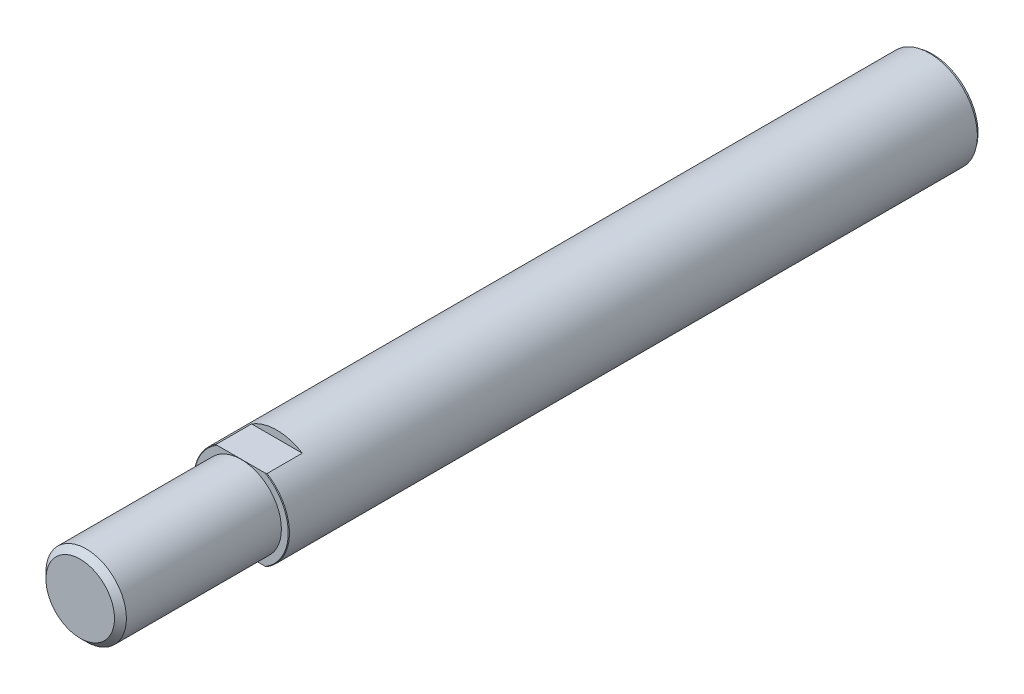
from build123d import *

# Parameters (mm, degrees)
ESBO_O1_R                       = 16
RESSALTO_EXTRUS_O1_DEPTH        = 286
ESBO_O2_OUTSIDE_W               = 91.912
ESBO_O2_OUTSIDE_H               = 91.912
ESBO_O2_OUTSIDE_R               = 13.5
CORTE_EXTRUS_O1_DEPTH           = 54
CHANFRO1_SIZE                   = 0.2
CHANFRO2_SIZE                   = 2
ESBO_O3_OUTSIDE_W               = 91.912
ESBO_O3_OUTSIDE_H               = 91.912
ESBO_O3_OUTSIDE_W_2             = 43.597020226
ESBO_O3_OUTSIDE_H_2             = 27.1
CORTE_EXTRUS_O2_DEPTH           = 12
ESBO_O4_OUTSIDE_W               = 91.912
ESBO_O4_OUTSIDE_H               = 91.912
ESBO_O4_OUTSIDE_R               = 15.25
CORTE_EXTRUS_O3_DEPTH           = 1
FURO_ROSCADO_DE_M12X1_751_D     = 10.2
FURO_ROSCADO_DE_M12X1_751_DEPTH = 32.75
FURO_ROSCADO_DE_M12X1_751_TIP   = 3.064389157


with BuildPart() as part:
    # Esbo_o1 → Ressalto-extrus_o1 (new body)
    with BuildSketch(Plane.XY):
        Circle(ESBO_O1_R)
    extrude(amount=RESSALTO_EXTRUS_O1_DEPTH)

    # Esbo_o2 outside → Corte-extrus_o1 (cut)
    with BuildSketch(Plane.XY.offset(286)):
        Rectangle(ESBO_O2_OUTSIDE_W, ESBO_O2_OUTSIDE_H)
        Circle(ESBO_O2_OUTSIDE_R, mode=Mode.SUBTRACT)
    extrude(amount=-CORTE_EXTRUS_O1_DEPTH, mode=Mode.SUBTRACT)

    # Chanfro1
    chanfro1_edges = [part.edges().sort_by_distance(p)[0] for p in [
        (-16, 0, 232),
    ]]
    chamfer(chanfro1_edges, length=CHANFRO1_SIZE)

    # Chanfro2
    chanfro2_edges = [part.edges().sort_by_distance(p)[0] for p in [
        (-13.5, 0, 286),
    ]]
    chamfer(chanfro2_edges, length=CHANFRO2_SIZE)

    # Esbo_o3 outside → Corte-extrus_o2 (cut)
    with BuildSketch(Plane.XY.offset(232)):
        Rectangle(ESBO_O3_OUTSIDE_W, ESBO_O3_OUTSIDE_H)
        Rectangle(ESBO_O3_OUTSIDE_W_2, ESBO_O3_OUTSIDE_H_2, mode=Mode.SUBTRACT)
    extrude(amount=-CORTE_EXTRUS_O2_DEPTH, mode=Mode.SUBTRACT)

    # Esbo_o4 outside → Corte-extrus_o3 (cut)
    with BuildSketch(Plane(origin=(0, 0, 0), x_dir=(-1, 0, 0), z_dir=(0, 0, -1))):
        Rectangle(ESBO_O4_OUTSIDE_W, ESBO_O4_OUTSIDE_H)
        Circle(ESBO_O4_OUTSIDE_R, mode=Mode.SUBTRACT)
    extrude(amount=-CORTE_EXTRUS_O3_DEPTH, mode=Mode.SUBTRACT)

    # Furo roscado de M12x1.751
    with Locations(Plane(origin=(0, 0, 0), x_dir=(-1, 0, 0), z_dir=(0, 0, -1))):
        with Locations((0, 0)):
            Hole(FURO_ROSCADO_DE_M12X1_751_D / 2, depth=FURO_ROSCADO_DE_M12X1_751_DEPTH)
            with Locations((0, 0, -(FURO_ROSCADO_DE_M12X1_751_DEPTH + FURO_ROSCADO_DE_M12X1_751_TIP / 2))):  # 118° drill point
                Cone(0, FURO_ROSCADO_DE_M12X1_751_D / 2, FURO_ROSCADO_DE_M12X1_751_TIP, mode=Mode.SUBTRACT)


solid = part.part
